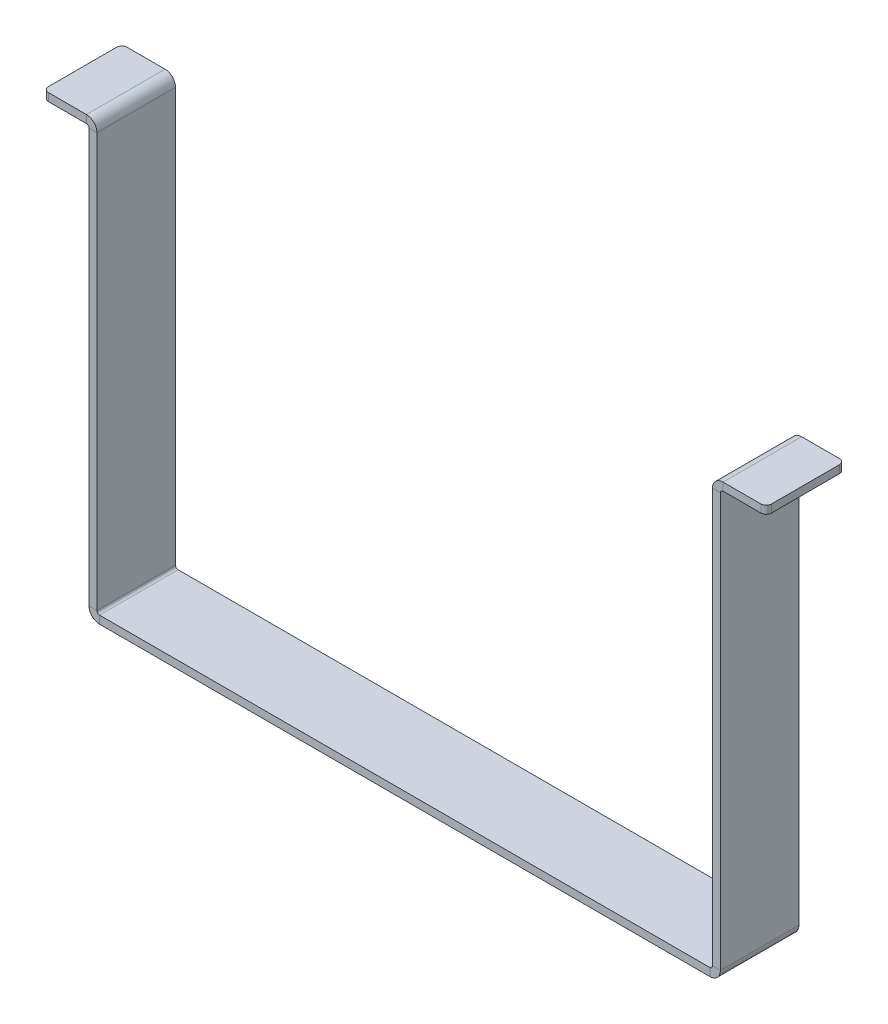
ISO-10303-21;
HEADER;
FILE_DESCRIPTION(('STEP AP214'),'2;1');
FILE_NAME('part.step','',(''),(''),'','','');
FILE_SCHEMA(('AUTOMOTIVE_DESIGN { 1 0 10303 214 1 1 1 1 }'));
ENDSEC;
DATA;
#1=APPLICATION_CONTEXT('core data for automotive mechanical design processes');
#2=APPLICATION_PROTOCOL_DEFINITION('international standard','automotive_design',2000,#1);
#3=PRODUCT_CONTEXT('',#1,'mechanical');
#4=PRODUCT('Part','Part','',(#3));
#5=PRODUCT_RELATED_PRODUCT_CATEGORY('part','',(#4));
#6=PRODUCT_DEFINITION_FORMATION('','',#4);
#7=PRODUCT_DEFINITION_CONTEXT('part definition',#1,'design');
#8=PRODUCT_DEFINITION('design','',#6,#7);
#9=PRODUCT_DEFINITION_SHAPE('','',#8);
#10=(LENGTH_UNIT() NAMED_UNIT(*) SI_UNIT(.MILLI.,.METRE.));
#11=(NAMED_UNIT(*) PLANE_ANGLE_UNIT() SI_UNIT($,.RADIAN.));
#12=(NAMED_UNIT(*) SI_UNIT($,.STERADIAN.) SOLID_ANGLE_UNIT());
#13=UNCERTAINTY_MEASURE_WITH_UNIT(LENGTH_MEASURE(1.E-05),#10,'distance_accuracy_value','');
#14=(GEOMETRIC_REPRESENTATION_CONTEXT(3) GLOBAL_UNCERTAINTY_ASSIGNED_CONTEXT((#13)) GLOBAL_UNIT_ASSIGNED_CONTEXT((#10,
#11,#12)) REPRESENTATION_CONTEXT('',''));
#15=CARTESIAN_POINT('',(0.,0.,0.));
#16=DIRECTION('',(0.,0.,1.));
#17=DIRECTION('',(1.,0.,0.));
#18=AXIS2_PLACEMENT_3D('',#15,#16,#17);
#19=CARTESIAN_POINT('',(117.5,-68.4762732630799,-15.));
#20=DIRECTION('',(0.,0.,1.));
#21=DIRECTION('',(0.,1.,0.));
#22=AXIS2_PLACEMENT_3D('',#19,#20,#21);
#23=PLANE('',#22);
#24=DIRECTION('',(1.,0.,0.));
#25=VECTOR('',#24,1.);
#26=CARTESIAN_POINT('',(117.5,1.11022302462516E-13,-15.));
#27=LINE('',#26,#25);
#28=CARTESIAN_POINT('',(121.5,1.11022302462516E-13,-15.));
#29=VERTEX_POINT('',#28);
#30=CARTESIAN_POINT('',(136.,1.11022302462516E-13,-15.));
#31=VERTEX_POINT('',#30);
#32=EDGE_CURVE('E402',#29,#31,#27,.T.);
#33=ORIENTED_EDGE('',*,*,#32,.T.);
#34=DIRECTION('',(0.,1.,0.));
#35=VECTOR('',#34,1.);
#36=CARTESIAN_POINT('',(136.,-68.4762732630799,-15.));
#37=LINE('',#36,#35);
#38=CARTESIAN_POINT('',(136.,-2.99999999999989,-15.));
#39=VERTEX_POINT('',#38);
#40=EDGE_CURVE('E426',#39,#31,#37,.T.);
#41=ORIENTED_EDGE('',*,*,#40,.F.);
#42=DIRECTION('',(1.,0.,0.));
#43=VECTOR('',#42,1.);
#44=CARTESIAN_POINT('',(117.5,-2.99999999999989,-15.));
#45=LINE('',#44,#43);
#46=CARTESIAN_POINT('',(121.5,-2.99999999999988,-15.0000000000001));
#47=VERTEX_POINT('',#46);
#48=EDGE_CURVE('E411',#47,#39,#45,.T.);
#49=ORIENTED_EDGE('',*,*,#48,.F.);
#50=DIRECTION('',(0.,1.,0.));
#51=VECTOR('',#50,1.);
#52=CARTESIAN_POINT('',(121.5,-68.4762732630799,-15.));
#53=LINE('',#52,#51);
#54=EDGE_CURVE('E428',#47,#29,#53,.T.);
#55=ORIENTED_EDGE('',*,*,#54,.T.);
#56=EDGE_LOOP('',(#33,#41,#49,#55));
#57=FACE_BOUND('',#56,.T.);
#58=ADVANCED_FACE('F28',(#57),#23,.F.);
#59=CARTESIAN_POINT('',(136.,-68.4762732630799,-13.));
#60=DIRECTION('',(0.,1.,0.));
#61=DIRECTION('',(-1.,0.,0.));
#62=AXIS2_PLACEMENT_3D('',#59,#60,#61);
#63=CYLINDRICAL_SURFACE('',#62,2.);
#64=CARTESIAN_POINT('',(136.,1.11022302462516E-13,-13.));
#65=DIRECTION('',(0.,1.,0.));
#66=DIRECTION('',(-1.,0.,0.));
#67=AXIS2_PLACEMENT_3D('',#64,#65,#66);
#68=CIRCLE('',#67,2.);
#69=CARTESIAN_POINT('',(138.,1.11022302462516E-13,-13.));
#70=VERTEX_POINT('',#69);
#71=EDGE_CURVE('E400',#70,#31,#68,.T.);
#72=ORIENTED_EDGE('',*,*,#71,.F.);
#73=DIRECTION('',(0.,1.,0.));
#74=VECTOR('',#73,1.);
#75=CARTESIAN_POINT('',(138.,-68.4762732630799,-13.));
#76=LINE('',#75,#74);
#77=CARTESIAN_POINT('',(138.,-2.99999999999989,-13.));
#78=VERTEX_POINT('',#77);
#79=EDGE_CURVE('E424',#78,#70,#76,.T.);
#80=ORIENTED_EDGE('',*,*,#79,.F.);
#81=CARTESIAN_POINT('',(136.,-2.99999999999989,-13.));
#82=DIRECTION('',(0.,1.,0.));
#83=DIRECTION('',(-1.,0.,0.));
#84=AXIS2_PLACEMENT_3D('',#81,#82,#83);
#85=CIRCLE('',#84,2.);
#86=EDGE_CURVE('E42',#39,#78,#85,.F.);
#87=ORIENTED_EDGE('',*,*,#86,.F.);
#88=ORIENTED_EDGE('',*,*,#40,.T.);
#89=EDGE_LOOP('',(#72,#80,#87,#88));
#90=FACE_BOUND('',#89,.T.);
#91=ADVANCED_FACE('F445',(#90),#63,.T.);
#92=CARTESIAN_POINT('',(138.,-68.4762732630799,15.));
#93=DIRECTION('',(1.,0.,0.));
#94=DIRECTION('',(0.,1.,0.));
#95=AXIS2_PLACEMENT_3D('',#92,#93,#94);
#96=PLANE('',#95);
#97=ORIENTED_EDGE('',*,*,#79,.T.);
#98=DIRECTION('',(0.,0.,-1.));
#99=VECTOR('',#98,1.);
#100=CARTESIAN_POINT('',(138.,1.11022302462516E-13,15.));
#101=LINE('',#100,#99);
#102=CARTESIAN_POINT('',(138.,1.11022302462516E-13,13.));
#103=VERTEX_POINT('',#102);
#104=EDGE_CURVE('E398',#103,#70,#101,.T.);
#105=ORIENTED_EDGE('',*,*,#104,.F.);
#106=DIRECTION('',(0.,1.,0.));
#107=VECTOR('',#106,1.);
#108=CARTESIAN_POINT('',(138.,-68.4762732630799,13.));
#109=LINE('',#108,#107);
#110=CARTESIAN_POINT('',(138.,-2.99999999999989,13.));
#111=VERTEX_POINT('',#110);
#112=EDGE_CURVE('E421',#111,#103,#109,.T.);
#113=ORIENTED_EDGE('',*,*,#112,.F.);
#114=DIRECTION('',(0.,0.,-1.));
#115=VECTOR('',#114,1.);
#116=CARTESIAN_POINT('',(138.,-2.99999999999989,15.));
#117=LINE('',#116,#115);
#118=EDGE_CURVE('E50',#111,#78,#117,.T.);
#119=ORIENTED_EDGE('',*,*,#118,.T.);
#120=EDGE_LOOP('',(#97,#105,#113,#119));
#121=FACE_BOUND('',#120,.T.);
#122=ADVANCED_FACE('F444',(#121),#96,.T.);
#123=CARTESIAN_POINT('',(136.,-68.4762732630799,13.));
#124=DIRECTION('',(0.,1.,0.));
#125=DIRECTION('',(-1.,0.,0.));
#126=AXIS2_PLACEMENT_3D('',#123,#124,#125);
#127=CYLINDRICAL_SURFACE('',#126,2.);
#128=CARTESIAN_POINT('',(136.,1.11022302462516E-13,13.));
#129=DIRECTION('',(0.,1.,0.));
#130=DIRECTION('',(-1.,0.,0.));
#131=AXIS2_PLACEMENT_3D('',#128,#129,#130);
#132=CIRCLE('',#131,2.);
#133=CARTESIAN_POINT('',(136.,1.11022302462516E-13,15.));
#134=VERTEX_POINT('',#133);
#135=EDGE_CURVE('E396',#134,#103,#132,.T.);
#136=ORIENTED_EDGE('',*,*,#135,.F.);
#137=DIRECTION('',(0.,1.,0.));
#138=VECTOR('',#137,1.);
#139=CARTESIAN_POINT('',(136.,-68.4762732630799,15.));
#140=LINE('',#139,#138);
#141=CARTESIAN_POINT('',(136.,-2.99999999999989,15.));
#142=VERTEX_POINT('',#141);
#143=EDGE_CURVE('E418',#142,#134,#140,.T.);
#144=ORIENTED_EDGE('',*,*,#143,.F.);
#145=CARTESIAN_POINT('',(136.,-2.99999999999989,13.));
#146=DIRECTION('',(0.,1.,0.));
#147=DIRECTION('',(-1.,0.,0.));
#148=AXIS2_PLACEMENT_3D('',#145,#146,#147);
#149=CIRCLE('',#148,2.);
#150=EDGE_CURVE('E408',#111,#142,#149,.F.);
#151=ORIENTED_EDGE('',*,*,#150,.F.);
#152=ORIENTED_EDGE('',*,*,#112,.T.);
#153=EDGE_LOOP('',(#136,#144,#151,#152));
#154=FACE_BOUND('',#153,.T.);
#155=ADVANCED_FACE('F438',(#154),#127,.T.);
#156=CARTESIAN_POINT('',(117.5,-68.4762732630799,15.));
#157=DIRECTION('',(0.,0.,1.));
#158=DIRECTION('',(0.,1.,0.));
#159=AXIS2_PLACEMENT_3D('',#156,#157,#158);
#160=PLANE('',#159);
#161=ORIENTED_EDGE('',*,*,#143,.T.);
#162=DIRECTION('',(-1.,0.,0.));
#163=VECTOR('',#162,1.);
#164=CARTESIAN_POINT('',(117.5,1.11022302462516E-13,15.));
#165=LINE('',#164,#163);
#166=CARTESIAN_POINT('',(121.5,1.17961196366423E-13,14.9999999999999));
#167=VERTEX_POINT('',#166);
#168=EDGE_CURVE('E11',#134,#167,#165,.T.);
#169=ORIENTED_EDGE('',*,*,#168,.T.);
#170=DIRECTION('',(0.,1.,0.));
#171=VECTOR('',#170,1.);
#172=CARTESIAN_POINT('',(121.5,-68.4762732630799,15.));
#173=LINE('',#172,#171);
#174=CARTESIAN_POINT('',(121.5,-2.99999999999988,14.9999999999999));
#175=VERTEX_POINT('',#174);
#176=EDGE_CURVE('E416',#175,#167,#173,.T.);
#177=ORIENTED_EDGE('',*,*,#176,.F.);
#178=DIRECTION('',(-1.,0.,0.));
#179=VECTOR('',#178,1.);
#180=CARTESIAN_POINT('',(117.5,-2.99999999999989,15.));
#181=LINE('',#180,#179);
#182=EDGE_CURVE('E35',#142,#175,#181,.T.);
#183=ORIENTED_EDGE('',*,*,#182,.F.);
#184=EDGE_LOOP('',(#161,#169,#177,#183));
#185=FACE_BOUND('',#184,.T.);
#186=ADVANCED_FACE('F435',(#185),#160,.T.);
#187=CARTESIAN_POINT('',(117.5,-2.99999999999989,15.));
#188=DIRECTION('',(0.,1.,0.));
#189=DIRECTION('',(-1.,0.,0.));
#190=AXIS2_PLACEMENT_3D('',#187,#188,#189);
#191=PLANE('',#190);
#192=ORIENTED_EDGE('',*,*,#182,.T.);
#193=DIRECTION('',(0.,0.,-1.));
#194=VECTOR('',#193,1.);
#195=CARTESIAN_POINT('',(121.5,-2.99999999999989,-15.));
#196=LINE('',#195,#194);
#197=EDGE_CURVE('E228',#175,#47,#196,.T.);
#198=ORIENTED_EDGE('',*,*,#197,.T.);
#199=ORIENTED_EDGE('',*,*,#48,.T.);
#200=ORIENTED_EDGE('',*,*,#86,.T.);
#201=ORIENTED_EDGE('',*,*,#118,.F.);
#202=ORIENTED_EDGE('',*,*,#150,.T.);
#203=EDGE_LOOP('',(#192,#198,#199,#200,#201,#202));
#204=FACE_BOUND('',#203,.T.);
#205=ADVANCED_FACE('F432',(#204),#191,.F.);
#206=CARTESIAN_POINT('',(117.5,1.11022302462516E-13,15.));
#207=DIRECTION('',(0.,1.,0.));
#208=DIRECTION('',(-1.,0.,0.));
#209=AXIS2_PLACEMENT_3D('',#206,#207,#208);
#210=PLANE('',#209);
#211=DIRECTION('',(0.,0.,-1.));
#212=VECTOR('',#211,1.);
#213=CARTESIAN_POINT('',(121.5,1.11022302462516E-13,-15.));
#214=LINE('',#213,#212);
#215=EDGE_CURVE('E405',#167,#29,#214,.T.);
#216=ORIENTED_EDGE('',*,*,#215,.F.);
#217=ORIENTED_EDGE('',*,*,#168,.F.);
#218=ORIENTED_EDGE('',*,*,#135,.T.);
#219=ORIENTED_EDGE('',*,*,#104,.T.);
#220=ORIENTED_EDGE('',*,*,#71,.T.);
#221=ORIENTED_EDGE('',*,*,#32,.F.);
#222=EDGE_LOOP('',(#216,#217,#218,#219,#220,#221));
#223=FACE_BOUND('',#222,.T.);
#224=ADVANCED_FACE('F442',(#223),#210,.T.);
#225=CARTESIAN_POINT('',(-138.,-68.47627326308,15.));
#226=DIRECTION('',(0.,0.,1.));
#227=DIRECTION('',(0.,1.,0.));
#228=AXIS2_PLACEMENT_3D('',#225,#226,#227);
#229=PLANE('',#228);
#230=DIRECTION('',(0.,1.,0.));
#231=VECTOR('',#230,1.);
#232=CARTESIAN_POINT('',(-121.5,-68.47627326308,15.));
#233=LINE('',#232,#231);
#234=CARTESIAN_POINT('',(-121.5,-3.,15.));
#235=VERTEX_POINT('',#234);
#236=CARTESIAN_POINT('',(-121.5,0.,15.));
#237=VERTEX_POINT('',#236);
#238=EDGE_CURVE('E393',#235,#237,#233,.T.);
#239=ORIENTED_EDGE('',*,*,#238,.T.);
#240=DIRECTION('',(1.,0.,0.));
#241=VECTOR('',#240,1.);
#242=CARTESIAN_POINT('',(-138.,0.,15.));
#243=LINE('',#242,#241);
#244=CARTESIAN_POINT('',(-136.,0.,15.));
#245=VERTEX_POINT('',#244);
#246=EDGE_CURVE('E354',#245,#237,#243,.T.);
#247=ORIENTED_EDGE('',*,*,#246,.F.);
#248=DIRECTION('',(0.,1.,0.));
#249=VECTOR('',#248,1.);
#250=CARTESIAN_POINT('',(-136.,-68.47627326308,15.));
#251=LINE('',#250,#249);
#252=CARTESIAN_POINT('',(-136.,-2.99999999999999,15.));
#253=VERTEX_POINT('',#252);
#254=EDGE_CURVE('E390',#253,#245,#251,.T.);
#255=ORIENTED_EDGE('',*,*,#254,.F.);
#256=DIRECTION('',(1.,0.,0.));
#257=VECTOR('',#256,1.);
#258=CARTESIAN_POINT('',(-138.,-2.99999999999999,15.));
#259=LINE('',#258,#257);
#260=EDGE_CURVE('E365',#253,#235,#259,.T.);
#261=ORIENTED_EDGE('',*,*,#260,.T.);
#262=EDGE_LOOP('',(#239,#247,#255,#261));
#263=FACE_BOUND('',#262,.T.);
#264=ADVANCED_FACE('F529',(#263),#229,.T.);
#265=CARTESIAN_POINT('',(-136.,-68.47627326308,13.));
#266=DIRECTION('',(0.,1.,0.));
#267=DIRECTION('',(-1.,0.,0.));
#268=AXIS2_PLACEMENT_3D('',#265,#266,#267);
#269=CYLINDRICAL_SURFACE('',#268,2.);
#270=CARTESIAN_POINT('',(-136.,0.,13.));
#271=DIRECTION('',(0.,1.,0.));
#272=DIRECTION('',(-1.,0.,0.));
#273=AXIS2_PLACEMENT_3D('',#270,#271,#272);
#274=CIRCLE('',#273,2.);
#275=CARTESIAN_POINT('',(-138.,0.,13.));
#276=VERTEX_POINT('',#275);
#277=EDGE_CURVE('E351',#276,#245,#274,.T.);
#278=ORIENTED_EDGE('',*,*,#277,.F.);
#279=DIRECTION('',(0.,1.,0.));
#280=VECTOR('',#279,1.);
#281=CARTESIAN_POINT('',(-138.,-68.47627326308,13.));
#282=LINE('',#281,#280);
#283=CARTESIAN_POINT('',(-138.,-2.99999999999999,13.));
#284=VERTEX_POINT('',#283);
#285=EDGE_CURVE('E387',#284,#276,#282,.T.);
#286=ORIENTED_EDGE('',*,*,#285,.F.);
#287=CARTESIAN_POINT('',(-136.,-2.99999999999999,13.));
#288=DIRECTION('',(0.,1.,0.));
#289=DIRECTION('',(-1.,0.,0.));
#290=AXIS2_PLACEMENT_3D('',#287,#288,#289);
#291=CIRCLE('',#290,2.);
#292=EDGE_CURVE('E368',#253,#284,#291,.F.);
#293=ORIENTED_EDGE('',*,*,#292,.F.);
#294=ORIENTED_EDGE('',*,*,#254,.T.);
#295=EDGE_LOOP('',(#278,#286,#293,#294));
#296=FACE_BOUND('',#295,.T.);
#297=ADVANCED_FACE('F537',(#296),#269,.T.);
#298=CARTESIAN_POINT('',(-138.,-68.47627326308,15.));
#299=DIRECTION('',(1.,0.,0.));
#300=DIRECTION('',(0.,1.,0.));
#301=AXIS2_PLACEMENT_3D('',#298,#299,#300);
#302=PLANE('',#301);
#303=DIRECTION('',(0.,0.,-1.));
#304=VECTOR('',#303,1.);
#305=CARTESIAN_POINT('',(-138.,0.,15.));
#306=LINE('',#305,#304);
#307=CARTESIAN_POINT('',(-138.,0.,-13.));
#308=VERTEX_POINT('',#307);
#309=EDGE_CURVE('E214',#276,#308,#306,.T.);
#310=ORIENTED_EDGE('',*,*,#309,.T.);
#311=DIRECTION('',(0.,1.,0.));
#312=VECTOR('',#311,1.);
#313=CARTESIAN_POINT('',(-138.,-68.47627326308,-13.));
#314=LINE('',#313,#312);
#315=CARTESIAN_POINT('',(-138.,-2.99999999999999,-13.));
#316=VERTEX_POINT('',#315);
#317=EDGE_CURVE('E384',#316,#308,#314,.T.);
#318=ORIENTED_EDGE('',*,*,#317,.F.);
#319=DIRECTION('',(0.,0.,-1.));
#320=VECTOR('',#319,1.);
#321=CARTESIAN_POINT('',(-138.,-2.99999999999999,15.));
#322=LINE('',#321,#320);
#323=EDGE_CURVE('E370',#284,#316,#322,.T.);
#324=ORIENTED_EDGE('',*,*,#323,.F.);
#325=ORIENTED_EDGE('',*,*,#285,.T.);
#326=EDGE_LOOP('',(#310,#318,#324,#325));
#327=FACE_BOUND('',#326,.T.);
#328=ADVANCED_FACE('F540',(#327),#302,.F.);
#329=CARTESIAN_POINT('',(-136.,-68.47627326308,-13.));
#330=DIRECTION('',(0.,1.,0.));
#331=DIRECTION('',(-1.,0.,0.));
#332=AXIS2_PLACEMENT_3D('',#329,#330,#331);
#333=CYLINDRICAL_SURFACE('',#332,2.);
#334=CARTESIAN_POINT('',(-136.,0.,-13.));
#335=DIRECTION('',(0.,1.,0.));
#336=DIRECTION('',(-1.,0.,0.));
#337=AXIS2_PLACEMENT_3D('',#334,#335,#336);
#338=CIRCLE('',#337,2.);
#339=CARTESIAN_POINT('',(-136.,0.,-15.));
#340=VERTEX_POINT('',#339);
#341=EDGE_CURVE('E360',#340,#308,#338,.T.);
#342=ORIENTED_EDGE('',*,*,#341,.F.);
#343=DIRECTION('',(0.,1.,0.));
#344=VECTOR('',#343,1.);
#345=CARTESIAN_POINT('',(-136.,-68.47627326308,-15.));
#346=LINE('',#345,#344);
#347=CARTESIAN_POINT('',(-136.,-2.99999999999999,-15.));
#348=VERTEX_POINT('',#347);
#349=EDGE_CURVE('E382',#348,#340,#346,.T.);
#350=ORIENTED_EDGE('',*,*,#349,.F.);
#351=CARTESIAN_POINT('',(-136.,-2.99999999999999,-13.));
#352=DIRECTION('',(0.,1.,0.));
#353=DIRECTION('',(-1.,0.,0.));
#354=AXIS2_PLACEMENT_3D('',#351,#352,#353);
#355=CIRCLE('',#354,2.);
#356=EDGE_CURVE('E372',#316,#348,#355,.F.);
#357=ORIENTED_EDGE('',*,*,#356,.F.);
#358=ORIENTED_EDGE('',*,*,#317,.T.);
#359=EDGE_LOOP('',(#342,#350,#357,#358));
#360=FACE_BOUND('',#359,.T.);
#361=ADVANCED_FACE('F543',(#360),#333,.T.);
#362=CARTESIAN_POINT('',(-138.,-68.47627326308,-15.));
#363=DIRECTION('',(0.,0.,1.));
#364=DIRECTION('',(0.,1.,0.));
#365=AXIS2_PLACEMENT_3D('',#362,#363,#364);
#366=PLANE('',#365);
#367=DIRECTION('',(1.,0.,0.));
#368=VECTOR('',#367,1.);
#369=CARTESIAN_POINT('',(-138.,0.,-15.));
#370=LINE('',#369,#368);
#371=CARTESIAN_POINT('',(-121.5,0.,-15.));
#372=VERTEX_POINT('',#371);
#373=EDGE_CURVE('E357',#340,#372,#370,.T.);
#374=ORIENTED_EDGE('',*,*,#373,.T.);
#375=DIRECTION('',(0.,1.,0.));
#376=VECTOR('',#375,1.);
#377=CARTESIAN_POINT('',(-121.5,-68.47627326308,-15.));
#378=LINE('',#377,#376);
#379=CARTESIAN_POINT('',(-121.5,-3.,-15.));
#380=VERTEX_POINT('',#379);
#381=EDGE_CURVE('E380',#380,#372,#378,.T.);
#382=ORIENTED_EDGE('',*,*,#381,.F.);
#383=DIRECTION('',(1.,0.,0.));
#384=VECTOR('',#383,1.);
#385=CARTESIAN_POINT('',(-138.,-2.99999999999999,-15.));
#386=LINE('',#385,#384);
#387=EDGE_CURVE('E374',#348,#380,#386,.T.);
#388=ORIENTED_EDGE('',*,*,#387,.F.);
#389=ORIENTED_EDGE('',*,*,#349,.T.);
#390=EDGE_LOOP('',(#374,#382,#388,#389));
#391=FACE_BOUND('',#390,.T.);
#392=ADVANCED_FACE('F517',(#391),#366,.F.);
#393=CARTESIAN_POINT('',(-138.,-2.99999999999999,15.));
#394=DIRECTION('',(0.,1.,0.));
#395=DIRECTION('',(-1.,0.,0.));
#396=AXIS2_PLACEMENT_3D('',#393,#394,#395);
#397=PLANE('',#396);
#398=ORIENTED_EDGE('',*,*,#387,.T.);
#399=DIRECTION('',(0.,0.,1.));
#400=VECTOR('',#399,1.);
#401=CARTESIAN_POINT('',(-121.5,-2.99999999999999,15.));
#402=LINE('',#401,#400);
#403=EDGE_CURVE('E377',#380,#235,#402,.T.);
#404=ORIENTED_EDGE('',*,*,#403,.T.);
#405=ORIENTED_EDGE('',*,*,#260,.F.);
#406=ORIENTED_EDGE('',*,*,#292,.T.);
#407=ORIENTED_EDGE('',*,*,#323,.T.);
#408=ORIENTED_EDGE('',*,*,#356,.T.);
#409=EDGE_LOOP('',(#398,#404,#405,#406,#407,#408));
#410=FACE_BOUND('',#409,.T.);
#411=ADVANCED_FACE('F533',(#410),#397,.F.);
#412=CARTESIAN_POINT('',(-138.,0.,15.));
#413=DIRECTION('',(0.,1.,0.));
#414=DIRECTION('',(-1.,0.,0.));
#415=AXIS2_PLACEMENT_3D('',#412,#413,#414);
#416=PLANE('',#415);
#417=DIRECTION('',(0.,0.,1.));
#418=VECTOR('',#417,1.);
#419=CARTESIAN_POINT('',(-121.5,0.,15.));
#420=LINE('',#419,#418);
#421=EDGE_CURVE('E363',#372,#237,#420,.T.);
#422=ORIENTED_EDGE('',*,*,#421,.F.);
#423=ORIENTED_EDGE('',*,*,#373,.F.);
#424=ORIENTED_EDGE('',*,*,#341,.T.);
#425=ORIENTED_EDGE('',*,*,#309,.F.);
#426=ORIENTED_EDGE('',*,*,#277,.T.);
#427=ORIENTED_EDGE('',*,*,#246,.T.);
#428=EDGE_LOOP('',(#422,#423,#424,#425,#426,#427));
#429=FACE_BOUND('',#428,.T.);
#430=ADVANCED_FACE('F523',(#429),#416,.T.);
#431=CARTESIAN_POINT('',(-204.145767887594,-163.,-15.));
#432=DIRECTION('',(0.,0.,-1.));
#433=DIRECTION('',(1.,0.,0.));
#434=AXIS2_PLACEMENT_3D('',#431,#432,#433);
#435=PLANE('',#434);
#436=DIRECTION('',(0.,1.,0.));
#437=VECTOR('',#436,1.);
#438=CARTESIAN_POINT('',(120.5,-163.,-15.));
#439=LINE('',#438,#437);
#440=CARTESIAN_POINT('',(120.5,-162.,-15.));
#441=VERTEX_POINT('',#440);
#442=CARTESIAN_POINT('',(120.5,-3.99999999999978,-15.));
#443=VERTEX_POINT('',#442);
#444=EDGE_CURVE('E198',#441,#443,#439,.T.);
#445=ORIENTED_EDGE('',*,*,#444,.F.);
#446=DIRECTION('',(1.,0.,0.));
#447=VECTOR('',#446,1.);
#448=CARTESIAN_POINT('',(-204.145767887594,-162.,-15.));
#449=LINE('',#448,#447);
#450=CARTESIAN_POINT('',(117.5,-162.,-15.));
#451=VERTEX_POINT('',#450);
#452=EDGE_CURVE('E345',#451,#441,#449,.T.);
#453=ORIENTED_EDGE('',*,*,#452,.F.);
#454=DIRECTION('',(0.,1.,0.));
#455=VECTOR('',#454,1.);
#456=CARTESIAN_POINT('',(117.5,-163.,-15.));
#457=LINE('',#456,#455);
#458=CARTESIAN_POINT('',(117.5,-3.99999999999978,-15.));
#459=VERTEX_POINT('',#458);
#460=EDGE_CURVE('E204',#451,#459,#457,.T.);
#461=ORIENTED_EDGE('',*,*,#460,.T.);
#462=DIRECTION('',(1.,0.,0.));
#463=VECTOR('',#462,1.);
#464=CARTESIAN_POINT('',(-204.145767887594,-3.99999999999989,-15.));
#465=LINE('',#464,#463);
#466=EDGE_CURVE('E347',#459,#443,#465,.T.);
#467=ORIENTED_EDGE('',*,*,#466,.T.);
#468=EDGE_LOOP('',(#445,#453,#461,#467));
#469=FACE_BOUND('',#468,.T.);
#470=ADVANCED_FACE('F456',(#469),#435,.T.);
#471=CARTESIAN_POINT('',(-204.145767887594,-163.,15.));
#472=DIRECTION('',(0.,0.,-1.));
#473=DIRECTION('',(1.,0.,0.));
#474=AXIS2_PLACEMENT_3D('',#471,#472,#473);
#475=PLANE('',#474);
#476=DIRECTION('',(1.,0.,0.));
#477=VECTOR('',#476,1.);
#478=CARTESIAN_POINT('',(-204.145767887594,-162.,15.));
#479=LINE('',#478,#477);
#480=CARTESIAN_POINT('',(117.5,-162.,15.));
#481=VERTEX_POINT('',#480);
#482=CARTESIAN_POINT('',(120.5,-162.,15.));
#483=VERTEX_POINT('',#482);
#484=EDGE_CURVE('E213',#481,#483,#479,.T.);
#485=ORIENTED_EDGE('',*,*,#484,.T.);
#486=DIRECTION('',(0.,1.,0.));
#487=VECTOR('',#486,1.);
#488=CARTESIAN_POINT('',(120.5,-163.,15.));
#489=LINE('',#488,#487);
#490=CARTESIAN_POINT('',(120.5,-3.99999999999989,14.9999999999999));
#491=VERTEX_POINT('',#490);
#492=EDGE_CURVE('E195',#483,#491,#489,.T.);
#493=ORIENTED_EDGE('',*,*,#492,.T.);
#494=DIRECTION('',(1.,0.,0.));
#495=VECTOR('',#494,1.);
#496=CARTESIAN_POINT('',(-204.145767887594,-3.99999999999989,15.));
#497=LINE('',#496,#495);
#498=CARTESIAN_POINT('',(117.5,-3.99999999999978,15.));
#499=VERTEX_POINT('',#498);
#500=EDGE_CURVE('E211',#499,#491,#497,.T.);
#501=ORIENTED_EDGE('',*,*,#500,.F.);
#502=DIRECTION('',(0.,1.,0.));
#503=VECTOR('',#502,1.);
#504=CARTESIAN_POINT('',(117.5,-163.,15.));
#505=LINE('',#504,#503);
#506=EDGE_CURVE('E215',#481,#499,#505,.T.);
#507=ORIENTED_EDGE('',*,*,#506,.F.);
#508=EDGE_LOOP('',(#485,#493,#501,#507));
#509=FACE_BOUND('',#508,.T.);
#510=ADVANCED_FACE('F209',(#509),#475,.F.);
#511=CARTESIAN_POINT('',(117.5,-163.,15.));
#512=DIRECTION('',(-1.,0.,0.));
#513=DIRECTION('',(0.,-1.,0.));
#514=AXIS2_PLACEMENT_3D('',#511,#512,#513);
#515=PLANE('',#514);
#516=DIRECTION('',(0.,0.,1.));
#517=VECTOR('',#516,1.);
#518=CARTESIAN_POINT('',(117.5,-3.99999999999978,-15.));
#519=LINE('',#518,#517);
#520=EDGE_CURVE('E224',#459,#499,#519,.T.);
#521=ORIENTED_EDGE('',*,*,#520,.F.);
#522=ORIENTED_EDGE('',*,*,#460,.F.);
#523=DIRECTION('',(0.,0.,-1.));
#524=VECTOR('',#523,1.);
#525=CARTESIAN_POINT('',(117.5,-162.,15.));
#526=LINE('',#525,#524);
#527=EDGE_CURVE('E340',#481,#451,#526,.T.);
#528=ORIENTED_EDGE('',*,*,#527,.F.);
#529=ORIENTED_EDGE('',*,*,#506,.T.);
#530=EDGE_LOOP('',(#521,#522,#528,#529));
#531=FACE_BOUND('',#530,.T.);
#532=ADVANCED_FACE('F462',(#531),#515,.T.);
#533=CARTESIAN_POINT('',(120.5,-163.,15.));
#534=DIRECTION('',(-1.,0.,0.));
#535=DIRECTION('',(0.,-1.,0.));
#536=AXIS2_PLACEMENT_3D('',#533,#534,#535);
#537=PLANE('',#536);
#538=ORIENTED_EDGE('',*,*,#444,.T.);
#539=DIRECTION('',(0.,0.,1.));
#540=VECTOR('',#539,1.);
#541=CARTESIAN_POINT('',(120.5,-3.99999999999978,-15.));
#542=LINE('',#541,#540);
#543=EDGE_CURVE('E191',#443,#491,#542,.T.);
#544=ORIENTED_EDGE('',*,*,#543,.T.);
#545=ORIENTED_EDGE('',*,*,#492,.F.);
#546=DIRECTION('',(0.,0.,-1.));
#547=VECTOR('',#546,1.);
#548=CARTESIAN_POINT('',(120.5,-162.,15.));
#549=LINE('',#548,#547);
#550=EDGE_CURVE('E205',#483,#441,#549,.T.);
#551=ORIENTED_EDGE('',*,*,#550,.T.);
#552=EDGE_LOOP('',(#538,#544,#545,#551));
#553=FACE_BOUND('',#552,.T.);
#554=ADVANCED_FACE('F193',(#553),#537,.F.);
#555=CARTESIAN_POINT('',(-117.5,306.846783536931,15.));
#556=DIRECTION('',(0.,0.,-1.));
#557=DIRECTION('',(0.,-1.,0.));
#558=AXIS2_PLACEMENT_3D('',#555,#556,#557);
#559=PLANE('',#558);
#560=DIRECTION('',(0.,-1.,0.));
#561=VECTOR('',#560,1.);
#562=CARTESIAN_POINT('',(-116.5,306.846783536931,15.));
#563=LINE('',#562,#561);
#564=CARTESIAN_POINT('',(-116.5,-163.,15.));
#565=VERTEX_POINT('',#564);
#566=CARTESIAN_POINT('',(-116.5,-166.,15.));
#567=VERTEX_POINT('',#566);
#568=EDGE_CURVE('E322',#565,#567,#563,.T.);
#569=ORIENTED_EDGE('',*,*,#568,.T.);
#570=DIRECTION('',(1.,0.,0.));
#571=VECTOR('',#570,1.);
#572=CARTESIAN_POINT('',(-117.5,-166.,15.));
#573=LINE('',#572,#571);
#574=CARTESIAN_POINT('',(116.5,-166.,15.));
#575=VERTEX_POINT('',#574);
#576=EDGE_CURVE('E308',#567,#575,#573,.T.);
#577=ORIENTED_EDGE('',*,*,#576,.T.);
#578=DIRECTION('',(0.,-1.,0.));
#579=VECTOR('',#578,1.);
#580=CARTESIAN_POINT('',(116.5,306.846783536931,15.));
#581=LINE('',#580,#579);
#582=CARTESIAN_POINT('',(116.5,-163.,15.));
#583=VERTEX_POINT('',#582);
#584=EDGE_CURVE('E330',#583,#575,#581,.T.);
#585=ORIENTED_EDGE('',*,*,#584,.F.);
#586=DIRECTION('',(1.,0.,0.));
#587=VECTOR('',#586,1.);
#588=CARTESIAN_POINT('',(-117.5,-163.,15.));
#589=LINE('',#588,#587);
#590=EDGE_CURVE('E316',#565,#583,#589,.T.);
#591=ORIENTED_EDGE('',*,*,#590,.F.);
#592=EDGE_LOOP('',(#569,#577,#585,#591));
#593=FACE_BOUND('',#592,.T.);
#594=ADVANCED_FACE('F486',(#593),#559,.F.);
#595=CARTESIAN_POINT('',(-117.5,306.846783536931,-15.));
#596=DIRECTION('',(0.,0.,-1.));
#597=DIRECTION('',(0.,-1.,0.));
#598=AXIS2_PLACEMENT_3D('',#595,#596,#597);
#599=PLANE('',#598);
#600=DIRECTION('',(1.,0.,0.));
#601=VECTOR('',#600,1.);
#602=CARTESIAN_POINT('',(-117.5,-166.,-15.));
#603=LINE('',#602,#601);
#604=CARTESIAN_POINT('',(-116.5,-166.,-15.));
#605=VERTEX_POINT('',#604);
#606=CARTESIAN_POINT('',(116.5,-166.,-15.));
#607=VERTEX_POINT('',#606);
#608=EDGE_CURVE('E305',#605,#607,#603,.T.);
#609=ORIENTED_EDGE('',*,*,#608,.F.);
#610=DIRECTION('',(0.,-1.,0.));
#611=VECTOR('',#610,1.);
#612=CARTESIAN_POINT('',(-116.5,306.846783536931,-15.));
#613=LINE('',#612,#611);
#614=CARTESIAN_POINT('',(-116.5,-163.,-15.));
#615=VERTEX_POINT('',#614);
#616=EDGE_CURVE('E325',#615,#605,#613,.T.);
#617=ORIENTED_EDGE('',*,*,#616,.F.);
#618=DIRECTION('',(1.,0.,0.));
#619=VECTOR('',#618,1.);
#620=CARTESIAN_POINT('',(-117.5,-163.,-15.));
#621=LINE('',#620,#619);
#622=CARTESIAN_POINT('',(116.5,-163.,-15.));
#623=VERTEX_POINT('',#622);
#624=EDGE_CURVE('E313',#615,#623,#621,.T.);
#625=ORIENTED_EDGE('',*,*,#624,.T.);
#626=DIRECTION('',(0.,-1.,0.));
#627=VECTOR('',#626,1.);
#628=CARTESIAN_POINT('',(116.5,306.846783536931,-15.));
#629=LINE('',#628,#627);
#630=EDGE_CURVE('E327',#623,#607,#629,.T.);
#631=ORIENTED_EDGE('',*,*,#630,.T.);
#632=EDGE_LOOP('',(#609,#617,#625,#631));
#633=FACE_BOUND('',#632,.T.);
#634=ADVANCED_FACE('F473',(#633),#599,.T.);
#635=CARTESIAN_POINT('',(-117.5,-163.,15.));
#636=DIRECTION('',(0.,1.,0.));
#637=DIRECTION('',(-1.,0.,0.));
#638=AXIS2_PLACEMENT_3D('',#635,#636,#637);
#639=PLANE('',#638);
#640=ORIENTED_EDGE('',*,*,#590,.T.);
#641=DIRECTION('',(0.,0.,-1.));
#642=VECTOR('',#641,1.);
#643=CARTESIAN_POINT('',(116.5,-163.,15.));
#644=LINE('',#643,#642);
#645=EDGE_CURVE('E319',#583,#623,#644,.T.);
#646=ORIENTED_EDGE('',*,*,#645,.T.);
#647=ORIENTED_EDGE('',*,*,#624,.F.);
#648=DIRECTION('',(0.,0.,-1.));
#649=VECTOR('',#648,1.);
#650=CARTESIAN_POINT('',(-116.5,-163.,15.));
#651=LINE('',#650,#649);
#652=EDGE_CURVE('E332',#565,#615,#651,.T.);
#653=ORIENTED_EDGE('',*,*,#652,.F.);
#654=EDGE_LOOP('',(#640,#646,#647,#653));
#655=FACE_BOUND('',#654,.T.);
#656=ADVANCED_FACE('F497',(#655),#639,.T.);
#657=CARTESIAN_POINT('',(-117.5,-166.,15.));
#658=DIRECTION('',(0.,1.,0.));
#659=DIRECTION('',(-1.,0.,0.));
#660=AXIS2_PLACEMENT_3D('',#657,#658,#659);
#661=PLANE('',#660);
#662=DIRECTION('',(0.,0.,-1.));
#663=VECTOR('',#662,1.);
#664=CARTESIAN_POINT('',(116.5,-166.,15.));
#665=LINE('',#664,#663);
#666=EDGE_CURVE('E311',#575,#607,#665,.T.);
#667=ORIENTED_EDGE('',*,*,#666,.F.);
#668=ORIENTED_EDGE('',*,*,#576,.F.);
#669=DIRECTION('',(0.,0.,-1.));
#670=VECTOR('',#669,1.);
#671=CARTESIAN_POINT('',(-116.5,-166.,15.));
#672=LINE('',#671,#670);
#673=EDGE_CURVE('E334',#567,#605,#672,.T.);
#674=ORIENTED_EDGE('',*,*,#673,.T.);
#675=ORIENTED_EDGE('',*,*,#608,.T.);
#676=EDGE_LOOP('',(#667,#668,#674,#675));
#677=FACE_BOUND('',#676,.T.);
#678=ADVANCED_FACE('F478',(#677),#661,.F.);
#679=CARTESIAN_POINT('',(204.145767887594,0.,15.));
#680=DIRECTION('',(0.,0.,-1.));
#681=DIRECTION('',(-1.,0.,0.));
#682=AXIS2_PLACEMENT_3D('',#679,#680,#681);
#683=PLANE('',#682);
#684=DIRECTION('',(-1.,0.,0.));
#685=VECTOR('',#684,1.);
#686=CARTESIAN_POINT('',(204.145767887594,-4.00000000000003,15.));
#687=LINE('',#686,#685);
#688=CARTESIAN_POINT('',(-117.5,-3.99999999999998,15.));
#689=VERTEX_POINT('',#688);
#690=CARTESIAN_POINT('',(-120.5,-4.,15.));
#691=VERTEX_POINT('',#690);
#692=EDGE_CURVE('E297',#689,#691,#687,.T.);
#693=ORIENTED_EDGE('',*,*,#692,.T.);
#694=DIRECTION('',(0.,-1.,0.));
#695=VECTOR('',#694,1.);
#696=CARTESIAN_POINT('',(-120.5,0.,15.));
#697=LINE('',#696,#695);
#698=CARTESIAN_POINT('',(-120.5,-162.,15.));
#699=VERTEX_POINT('',#698);
#700=EDGE_CURVE('E272',#691,#699,#697,.T.);
#701=ORIENTED_EDGE('',*,*,#700,.T.);
#702=DIRECTION('',(-1.,0.,0.));
#703=VECTOR('',#702,1.);
#704=CARTESIAN_POINT('',(204.145767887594,-162.,15.));
#705=LINE('',#704,#703);
#706=CARTESIAN_POINT('',(-117.5,-162.,15.));
#707=VERTEX_POINT('',#706);
#708=EDGE_CURVE('E295',#707,#699,#705,.T.);
#709=ORIENTED_EDGE('',*,*,#708,.F.);
#710=DIRECTION('',(0.,-1.,0.));
#711=VECTOR('',#710,1.);
#712=CARTESIAN_POINT('',(-117.5,0.,15.));
#713=LINE('',#712,#711);
#714=EDGE_CURVE('E280',#689,#707,#713,.T.);
#715=ORIENTED_EDGE('',*,*,#714,.F.);
#716=EDGE_LOOP('',(#693,#701,#709,#715));
#717=FACE_BOUND('',#716,.T.);
#718=ADVANCED_FACE('F648',(#717),#683,.F.);
#719=CARTESIAN_POINT('',(204.145767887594,0.,-15.));
#720=DIRECTION('',(0.,0.,-1.));
#721=DIRECTION('',(-1.,0.,0.));
#722=AXIS2_PLACEMENT_3D('',#719,#720,#721);
#723=PLANE('',#722);
#724=DIRECTION('',(0.,-1.,0.));
#725=VECTOR('',#724,1.);
#726=CARTESIAN_POINT('',(-120.5,0.,-15.));
#727=LINE('',#726,#725);
#728=CARTESIAN_POINT('',(-120.5,-4.,-15.));
#729=VERTEX_POINT('',#728);
#730=CARTESIAN_POINT('',(-120.5,-162.,-15.));
#731=VERTEX_POINT('',#730);
#732=EDGE_CURVE('E302',#729,#731,#727,.T.);
#733=ORIENTED_EDGE('',*,*,#732,.F.);
#734=DIRECTION('',(-1.,0.,0.));
#735=VECTOR('',#734,1.);
#736=CARTESIAN_POINT('',(204.145767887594,-4.00000000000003,-15.));
#737=LINE('',#736,#735);
#738=CARTESIAN_POINT('',(-117.5,-3.99999999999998,-15.));
#739=VERTEX_POINT('',#738);
#740=EDGE_CURVE('E289',#739,#729,#737,.T.);
#741=ORIENTED_EDGE('',*,*,#740,.F.);
#742=DIRECTION('',(0.,-1.,0.));
#743=VECTOR('',#742,1.);
#744=CARTESIAN_POINT('',(-117.5,0.,-15.));
#745=LINE('',#744,#743);
#746=CARTESIAN_POINT('',(-117.5,-162.,-15.));
#747=VERTEX_POINT('',#746);
#748=EDGE_CURVE('E299',#739,#747,#745,.T.);
#749=ORIENTED_EDGE('',*,*,#748,.T.);
#750=DIRECTION('',(-1.,0.,0.));
#751=VECTOR('',#750,1.);
#752=CARTESIAN_POINT('',(204.145767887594,-162.,-15.));
#753=LINE('',#752,#751);
#754=EDGE_CURVE('E292',#747,#731,#753,.T.);
#755=ORIENTED_EDGE('',*,*,#754,.T.);
#756=EDGE_LOOP('',(#733,#741,#749,#755));
#757=FACE_BOUND('',#756,.T.);
#758=ADVANCED_FACE('F506',(#757),#723,.T.);
#759=CARTESIAN_POINT('',(-117.5,0.,15.));
#760=DIRECTION('',(1.,0.,0.));
#761=DIRECTION('',(0.,1.,0.));
#762=AXIS2_PLACEMENT_3D('',#759,#760,#761);
#763=PLANE('',#762);
#764=DIRECTION('',(0.,0.,-1.));
#765=VECTOR('',#764,1.);
#766=CARTESIAN_POINT('',(-117.5,-4.,15.));
#767=LINE('',#766,#765);
#768=EDGE_CURVE('E286',#689,#739,#767,.T.);
#769=ORIENTED_EDGE('',*,*,#768,.F.);
#770=ORIENTED_EDGE('',*,*,#714,.T.);
#771=DIRECTION('',(0.,0.,-1.));
#772=VECTOR('',#771,1.);
#773=CARTESIAN_POINT('',(-117.5,-162.,15.));
#774=LINE('',#773,#772);
#775=EDGE_CURVE('E283',#707,#747,#774,.T.);
#776=ORIENTED_EDGE('',*,*,#775,.T.);
#777=ORIENTED_EDGE('',*,*,#748,.F.);
#778=EDGE_LOOP('',(#769,#770,#776,#777));
#779=FACE_BOUND('',#778,.T.);
#780=ADVANCED_FACE('F501',(#779),#763,.T.);
#781=CARTESIAN_POINT('',(-120.5,0.,15.));
#782=DIRECTION('',(1.,0.,0.));
#783=DIRECTION('',(0.,1.,0.));
#784=AXIS2_PLACEMENT_3D('',#781,#782,#783);
#785=PLANE('',#784);
#786=ORIENTED_EDGE('',*,*,#700,.F.);
#787=DIRECTION('',(0.,0.,-1.));
#788=VECTOR('',#787,1.);
#789=CARTESIAN_POINT('',(-120.5,-4.,15.));
#790=LINE('',#789,#788);
#791=EDGE_CURVE('E277',#691,#729,#790,.T.);
#792=ORIENTED_EDGE('',*,*,#791,.T.);
#793=ORIENTED_EDGE('',*,*,#732,.T.);
#794=DIRECTION('',(0.,0.,-1.));
#795=VECTOR('',#794,1.);
#796=CARTESIAN_POINT('',(-120.5,-162.,15.));
#797=LINE('',#796,#795);
#798=EDGE_CURVE('E275',#699,#731,#797,.T.);
#799=ORIENTED_EDGE('',*,*,#798,.F.);
#800=EDGE_LOOP('',(#786,#792,#793,#799));
#801=FACE_BOUND('',#800,.T.);
#802=ADVANCED_FACE('F668',(#801),#785,.F.);
#803=CARTESIAN_POINT('',(-116.5,-162.,-15.));
#804=DIRECTION('',(0.,0.,-1.));
#805=DIRECTION('',(-1.,0.,0.));
#806=AXIS2_PLACEMENT_3D('',#803,#804,#805);
#807=PLANE('',#806);
#808=ORIENTED_EDGE('',*,*,#754,.F.);
#809=CARTESIAN_POINT('',(-116.5,-162.,-15.));
#810=DIRECTION('',(0.,0.,-1.));
#811=DIRECTION('',(-1.,0.,0.));
#812=AXIS2_PLACEMENT_3D('',#809,#810,#811);
#813=CIRCLE('',#812,0.999999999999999);
#814=EDGE_CURVE('E263',#747,#615,#813,.F.);
#815=ORIENTED_EDGE('',*,*,#814,.T.);
#816=ORIENTED_EDGE('',*,*,#616,.T.);
#817=CARTESIAN_POINT('',(-116.5,-162.,-15.));
#818=DIRECTION('',(0.,0.,-1.));
#819=DIRECTION('',(-1.,0.,0.));
#820=AXIS2_PLACEMENT_3D('',#817,#818,#819);
#821=CIRCLE('',#820,4.);
#822=EDGE_CURVE('E269',#731,#605,#821,.F.);
#823=ORIENTED_EDGE('',*,*,#822,.F.);
#824=EDGE_LOOP('',(#808,#815,#816,#823));
#825=FACE_BOUND('',#824,.T.);
#826=ADVANCED_FACE('F499',(#825),#807,.T.);
#827=CARTESIAN_POINT('',(-116.5,-162.,15.));
#828=DIRECTION('',(0.,0.,1.));
#829=DIRECTION('',(1.,0.,0.));
#830=AXIS2_PLACEMENT_3D('',#827,#828,#829);
#831=PLANE('',#830);
#832=ORIENTED_EDGE('',*,*,#568,.F.);
#833=CARTESIAN_POINT('',(-116.5,-162.,15.));
#834=DIRECTION('',(0.,0.,-1.));
#835=DIRECTION('',(-1.,0.,0.));
#836=AXIS2_PLACEMENT_3D('',#833,#834,#835);
#837=CIRCLE('',#836,0.999999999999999);
#838=EDGE_CURVE('E261',#565,#707,#837,.T.);
#839=ORIENTED_EDGE('',*,*,#838,.T.);
#840=ORIENTED_EDGE('',*,*,#708,.T.);
#841=CARTESIAN_POINT('',(-116.5,-162.,15.));
#842=DIRECTION('',(0.,0.,-1.));
#843=DIRECTION('',(-1.,0.,0.));
#844=AXIS2_PLACEMENT_3D('',#841,#842,#843);
#845=CIRCLE('',#844,4.);
#846=EDGE_CURVE('E266',#567,#699,#845,.T.);
#847=ORIENTED_EDGE('',*,*,#846,.F.);
#848=EDGE_LOOP('',(#832,#839,#840,#847));
#849=FACE_BOUND('',#848,.T.);
#850=ADVANCED_FACE('F490',(#849),#831,.T.);
#851=CARTESIAN_POINT('',(-116.5,-162.,605.769836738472));
#852=DIRECTION('',(0.,0.,-1.));
#853=DIRECTION('',(-1.,0.,0.));
#854=AXIS2_PLACEMENT_3D('',#851,#852,#853);
#855=CYLINDRICAL_SURFACE('',#854,4.);
#856=ORIENTED_EDGE('',*,*,#846,.T.);
#857=ORIENTED_EDGE('',*,*,#798,.T.);
#858=ORIENTED_EDGE('',*,*,#822,.T.);
#859=ORIENTED_EDGE('',*,*,#673,.F.);
#860=EDGE_LOOP('',(#856,#857,#858,#859));
#861=FACE_BOUND('',#860,.T.);
#862=ADVANCED_FACE('F482',(#861),#855,.T.);
#863=CARTESIAN_POINT('',(-116.5,-162.,605.769836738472));
#864=DIRECTION('',(0.,0.,-1.));
#865=DIRECTION('',(-1.,0.,0.));
#866=AXIS2_PLACEMENT_3D('',#863,#864,#865);
#867=CYLINDRICAL_SURFACE('',#866,0.999999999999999);
#868=ORIENTED_EDGE('',*,*,#838,.F.);
#869=ORIENTED_EDGE('',*,*,#652,.T.);
#870=ORIENTED_EDGE('',*,*,#814,.F.);
#871=ORIENTED_EDGE('',*,*,#775,.F.);
#872=EDGE_LOOP('',(#868,#869,#870,#871));
#873=FACE_BOUND('',#872,.T.);
#874=ADVANCED_FACE('F494',(#873),#867,.F.);
#875=CARTESIAN_POINT('',(116.5,-162.,-15.));
#876=DIRECTION('',(0.,0.,-1.));
#877=DIRECTION('',(-1.,0.,0.));
#878=AXIS2_PLACEMENT_3D('',#875,#876,#877);
#879=PLANE('',#878);
#880=ORIENTED_EDGE('',*,*,#630,.F.);
#881=CARTESIAN_POINT('',(116.5,-162.,-15.));
#882=DIRECTION('',(0.,0.,-1.));
#883=DIRECTION('',(-1.,0.,0.));
#884=AXIS2_PLACEMENT_3D('',#881,#882,#883);
#885=CIRCLE('',#884,1.);
#886=EDGE_CURVE('E252',#623,#451,#885,.F.);
#887=ORIENTED_EDGE('',*,*,#886,.T.);
#888=ORIENTED_EDGE('',*,*,#452,.T.);
#889=CARTESIAN_POINT('',(116.5,-162.,-15.));
#890=DIRECTION('',(0.,0.,-1.));
#891=DIRECTION('',(-1.,0.,0.));
#892=AXIS2_PLACEMENT_3D('',#889,#890,#891);
#893=CIRCLE('',#892,4.);
#894=EDGE_CURVE('E258',#607,#441,#893,.F.);
#895=ORIENTED_EDGE('',*,*,#894,.F.);
#896=EDGE_LOOP('',(#880,#887,#888,#895));
#897=FACE_BOUND('',#896,.T.);
#898=ADVANCED_FACE('F469',(#897),#879,.T.);
#899=CARTESIAN_POINT('',(116.5,-162.,15.));
#900=DIRECTION('',(0.,0.,1.));
#901=DIRECTION('',(1.,0.,0.));
#902=AXIS2_PLACEMENT_3D('',#899,#900,#901);
#903=PLANE('',#902);
#904=ORIENTED_EDGE('',*,*,#484,.F.);
#905=CARTESIAN_POINT('',(116.5,-162.,15.));
#906=DIRECTION('',(0.,0.,-1.));
#907=DIRECTION('',(-1.,0.,0.));
#908=AXIS2_PLACEMENT_3D('',#905,#906,#907);
#909=CIRCLE('',#908,1.);
#910=EDGE_CURVE('E250',#481,#583,#909,.T.);
#911=ORIENTED_EDGE('',*,*,#910,.T.);
#912=ORIENTED_EDGE('',*,*,#584,.T.);
#913=CARTESIAN_POINT('',(116.5,-162.,15.));
#914=DIRECTION('',(0.,0.,-1.));
#915=DIRECTION('',(-1.,0.,0.));
#916=AXIS2_PLACEMENT_3D('',#913,#914,#915);
#917=CIRCLE('',#916,4.);
#918=EDGE_CURVE('E255',#483,#575,#917,.T.);
#919=ORIENTED_EDGE('',*,*,#918,.F.);
#920=EDGE_LOOP('',(#904,#911,#912,#919));
#921=FACE_BOUND('',#920,.T.);
#922=ADVANCED_FACE('F706',(#921),#903,.T.);
#923=CARTESIAN_POINT('',(116.5,-162.,469.004955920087));
#924=DIRECTION('',(0.,0.,-1.));
#925=DIRECTION('',(-1.,0.,0.));
#926=AXIS2_PLACEMENT_3D('',#923,#924,#925);
#927=CYLINDRICAL_SURFACE('',#926,4.);
#928=ORIENTED_EDGE('',*,*,#918,.T.);
#929=ORIENTED_EDGE('',*,*,#666,.T.);
#930=ORIENTED_EDGE('',*,*,#894,.T.);
#931=ORIENTED_EDGE('',*,*,#550,.F.);
#932=EDGE_LOOP('',(#928,#929,#930,#931));
#933=FACE_BOUND('',#932,.T.);
#934=ADVANCED_FACE('F713',(#933),#927,.T.);
#935=CARTESIAN_POINT('',(116.5,-162.,469.004955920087));
#936=DIRECTION('',(0.,0.,-1.));
#937=DIRECTION('',(-1.,0.,0.));
#938=AXIS2_PLACEMENT_3D('',#935,#936,#937);
#939=CYLINDRICAL_SURFACE('',#938,1.);
#940=ORIENTED_EDGE('',*,*,#910,.F.);
#941=ORIENTED_EDGE('',*,*,#527,.T.);
#942=ORIENTED_EDGE('',*,*,#886,.F.);
#943=ORIENTED_EDGE('',*,*,#645,.F.);
#944=EDGE_LOOP('',(#940,#941,#942,#943));
#945=FACE_BOUND('',#944,.T.);
#946=ADVANCED_FACE('F466',(#945),#939,.F.);
#947=CARTESIAN_POINT('',(-121.5,-4.,15.));
#948=DIRECTION('',(0.,0.,-1.));
#949=DIRECTION('',(-1.,0.,0.));
#950=AXIS2_PLACEMENT_3D('',#947,#948,#949);
#951=PLANE('',#950);
#952=ORIENTED_EDGE('',*,*,#238,.F.);
#953=CARTESIAN_POINT('',(-121.5,-4.,15.));
#954=DIRECTION('',(0.,0.,-1.));
#955=DIRECTION('',(-1.,0.,0.));
#956=AXIS2_PLACEMENT_3D('',#953,#954,#955);
#957=CIRCLE('',#956,1.00000000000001);
#958=EDGE_CURVE('E241',#691,#235,#957,.F.);
#959=ORIENTED_EDGE('',*,*,#958,.F.);
#960=ORIENTED_EDGE('',*,*,#692,.F.);
#961=CARTESIAN_POINT('',(-121.5,-4.,15.));
#962=DIRECTION('',(0.,0.,-1.));
#963=DIRECTION('',(-1.,0.,0.));
#964=AXIS2_PLACEMENT_3D('',#961,#962,#963);
#965=CIRCLE('',#964,4.00000000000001);
#966=EDGE_CURVE('E247',#689,#237,#965,.F.);
#967=ORIENTED_EDGE('',*,*,#966,.T.);
#968=EDGE_LOOP('',(#952,#959,#960,#967));
#969=FACE_BOUND('',#968,.T.);
#970=ADVANCED_FACE('F526',(#969),#951,.F.);
#971=CARTESIAN_POINT('',(-121.5,-4.,-15.));
#972=DIRECTION('',(0.,0.,1.));
#973=DIRECTION('',(1.,0.,0.));
#974=AXIS2_PLACEMENT_3D('',#971,#972,#973);
#975=PLANE('',#974);
#976=ORIENTED_EDGE('',*,*,#740,.T.);
#977=CARTESIAN_POINT('',(-121.5,-4.,-15.));
#978=DIRECTION('',(0.,0.,-1.));
#979=DIRECTION('',(-1.,0.,0.));
#980=AXIS2_PLACEMENT_3D('',#977,#978,#979);
#981=CIRCLE('',#980,1.00000000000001);
#982=EDGE_CURVE('E238',#380,#729,#981,.T.);
#983=ORIENTED_EDGE('',*,*,#982,.F.);
#984=ORIENTED_EDGE('',*,*,#381,.T.);
#985=CARTESIAN_POINT('',(-121.5,-4.,-15.));
#986=DIRECTION('',(0.,0.,-1.));
#987=DIRECTION('',(-1.,0.,0.));
#988=AXIS2_PLACEMENT_3D('',#985,#986,#987);
#989=CIRCLE('',#988,4.00000000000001);
#990=EDGE_CURVE('E244',#372,#739,#989,.T.);
#991=ORIENTED_EDGE('',*,*,#990,.T.);
#992=EDGE_LOOP('',(#976,#983,#984,#991));
#993=FACE_BOUND('',#992,.T.);
#994=ADVANCED_FACE('F512',(#993),#975,.F.);
#995=CARTESIAN_POINT('',(-121.5,-4.,317.590895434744));
#996=DIRECTION('',(0.,0.,-1.));
#997=DIRECTION('',(-1.,0.,0.));
#998=AXIS2_PLACEMENT_3D('',#995,#996,#997);
#999=CYLINDRICAL_SURFACE('',#998,4.00000000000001);
#1000=ORIENTED_EDGE('',*,*,#990,.F.);
#1001=ORIENTED_EDGE('',*,*,#421,.T.);
#1002=ORIENTED_EDGE('',*,*,#966,.F.);
#1003=ORIENTED_EDGE('',*,*,#768,.T.);
#1004=EDGE_LOOP('',(#1000,#1001,#1002,#1003));
#1005=FACE_BOUND('',#1004,.T.);
#1006=ADVANCED_FACE('F511',(#1005),#999,.T.);
#1007=CARTESIAN_POINT('',(-121.5,-4.,317.590895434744));
#1008=DIRECTION('',(0.,0.,-1.));
#1009=DIRECTION('',(-1.,0.,0.));
#1010=AXIS2_PLACEMENT_3D('',#1007,#1008,#1009);
#1011=CYLINDRICAL_SURFACE('',#1010,1.00000000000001);
#1012=ORIENTED_EDGE('',*,*,#982,.T.);
#1013=ORIENTED_EDGE('',*,*,#791,.F.);
#1014=ORIENTED_EDGE('',*,*,#958,.T.);
#1015=ORIENTED_EDGE('',*,*,#403,.F.);
#1016=EDGE_LOOP('',(#1012,#1013,#1014,#1015));
#1017=FACE_BOUND('',#1016,.T.);
#1018=ADVANCED_FACE('F746',(#1017),#1011,.F.);
#1019=CARTESIAN_POINT('',(121.5,-3.99999999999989,-15.));
#1020=DIRECTION('',(0.,0.,1.));
#1021=DIRECTION('',(1.,0.,0.));
#1022=AXIS2_PLACEMENT_3D('',#1019,#1020,#1021);
#1023=PLANE('',#1022);
#1024=ORIENTED_EDGE('',*,*,#54,.F.);
#1025=CARTESIAN_POINT('',(121.5,-3.99999999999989,-15.0000000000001));
#1026=DIRECTION('',(0.,0.,1.));
#1027=DIRECTION('',(1.,0.,0.));
#1028=AXIS2_PLACEMENT_3D('',#1025,#1026,#1027);
#1029=CIRCLE('',#1028,1.00000000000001);
#1030=EDGE_CURVE('E230',#443,#47,#1029,.F.);
#1031=ORIENTED_EDGE('',*,*,#1030,.F.);
#1032=ORIENTED_EDGE('',*,*,#466,.F.);
#1033=CARTESIAN_POINT('',(121.5,-3.99999999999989,-15.0000000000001));
#1034=DIRECTION('',(0.,0.,1.));
#1035=DIRECTION('',(1.,0.,0.));
#1036=AXIS2_PLACEMENT_3D('',#1033,#1034,#1035);
#1037=CIRCLE('',#1036,4.00000000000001);
#1038=EDGE_CURVE('E235',#459,#29,#1037,.F.);
#1039=ORIENTED_EDGE('',*,*,#1038,.T.);
#1040=EDGE_LOOP('',(#1024,#1031,#1032,#1039));
#1041=FACE_BOUND('',#1040,.T.);
#1042=ADVANCED_FACE('F454',(#1041),#1023,.F.);
#1043=CARTESIAN_POINT('',(121.5,-3.99999999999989,15.));
#1044=DIRECTION('',(0.,0.,-1.));
#1045=DIRECTION('',(-1.,0.,0.));
#1046=AXIS2_PLACEMENT_3D('',#1043,#1044,#1045);
#1047=PLANE('',#1046);
#1048=ORIENTED_EDGE('',*,*,#500,.T.);
#1049=CARTESIAN_POINT('',(121.5,-3.99999999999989,14.9999999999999));
#1050=DIRECTION('',(0.,0.,1.));
#1051=DIRECTION('',(1.,0.,0.));
#1052=AXIS2_PLACEMENT_3D('',#1049,#1050,#1051);
#1053=CIRCLE('',#1052,1.00000000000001);
#1054=EDGE_CURVE('E220',#175,#491,#1053,.T.);
#1055=ORIENTED_EDGE('',*,*,#1054,.F.);
#1056=ORIENTED_EDGE('',*,*,#176,.T.);
#1057=CARTESIAN_POINT('',(121.5,-3.99999999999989,14.9999999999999));
#1058=DIRECTION('',(0.,0.,1.));
#1059=DIRECTION('',(1.,0.,0.));
#1060=AXIS2_PLACEMENT_3D('',#1057,#1058,#1059);
#1061=CIRCLE('',#1060,4.00000000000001);
#1062=EDGE_CURVE('E223',#167,#499,#1061,.T.);
#1063=ORIENTED_EDGE('',*,*,#1062,.T.);
#1064=EDGE_LOOP('',(#1048,#1055,#1056,#1063));
#1065=FACE_BOUND('',#1064,.T.);
#1066=ADVANCED_FACE('F219',(#1065),#1047,.F.);
#1067=CARTESIAN_POINT('',(121.5,-3.99999999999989,-331.70569934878));
#1068=DIRECTION('',(0.,0.,1.));
#1069=DIRECTION('',(1.,0.,0.));
#1070=AXIS2_PLACEMENT_3D('',#1067,#1068,#1069);
#1071=CYLINDRICAL_SURFACE('',#1070,4.00000000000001);
#1072=ORIENTED_EDGE('',*,*,#1062,.F.);
#1073=ORIENTED_EDGE('',*,*,#215,.T.);
#1074=ORIENTED_EDGE('',*,*,#1038,.F.);
#1075=ORIENTED_EDGE('',*,*,#520,.T.);
#1076=EDGE_LOOP('',(#1072,#1073,#1074,#1075));
#1077=FACE_BOUND('',#1076,.T.);
#1078=ADVANCED_FACE('F451',(#1077),#1071,.T.);
#1079=CARTESIAN_POINT('',(121.5,-3.99999999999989,-331.70569934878));
#1080=DIRECTION('',(0.,0.,1.));
#1081=DIRECTION('',(1.,0.,0.));
#1082=AXIS2_PLACEMENT_3D('',#1079,#1080,#1081);
#1083=CYLINDRICAL_SURFACE('',#1082,1.00000000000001);
#1084=ORIENTED_EDGE('',*,*,#1054,.T.);
#1085=ORIENTED_EDGE('',*,*,#543,.F.);
#1086=ORIENTED_EDGE('',*,*,#1030,.T.);
#1087=ORIENTED_EDGE('',*,*,#197,.F.);
#1088=EDGE_LOOP('',(#1084,#1085,#1086,#1087));
#1089=FACE_BOUND('',#1088,.T.);
#1090=ADVANCED_FACE('F226',(#1089),#1083,.F.);
#1091=CLOSED_SHELL('',(#58,#91,#122,#155,#186,#205,#224,#264,#297,#328,#361,#392,#411,#430,#470,
#510,#532,#554,#594,#634,#656,#678,#718,#758,#780,#802,#826,#850,#862,#874,#898,#922,#934,#946,
#970,#994,#1006,#1018,#1042,#1066,#1078,#1090));
#1092=MANIFOLD_SOLID_BREP('B2',#1091);
#1093=ADVANCED_BREP_SHAPE_REPRESENTATION('',(#18,#1092),#14);
#1094=SHAPE_DEFINITION_REPRESENTATION(#9,#1093);
ENDSEC;
END-ISO-10303-21;
